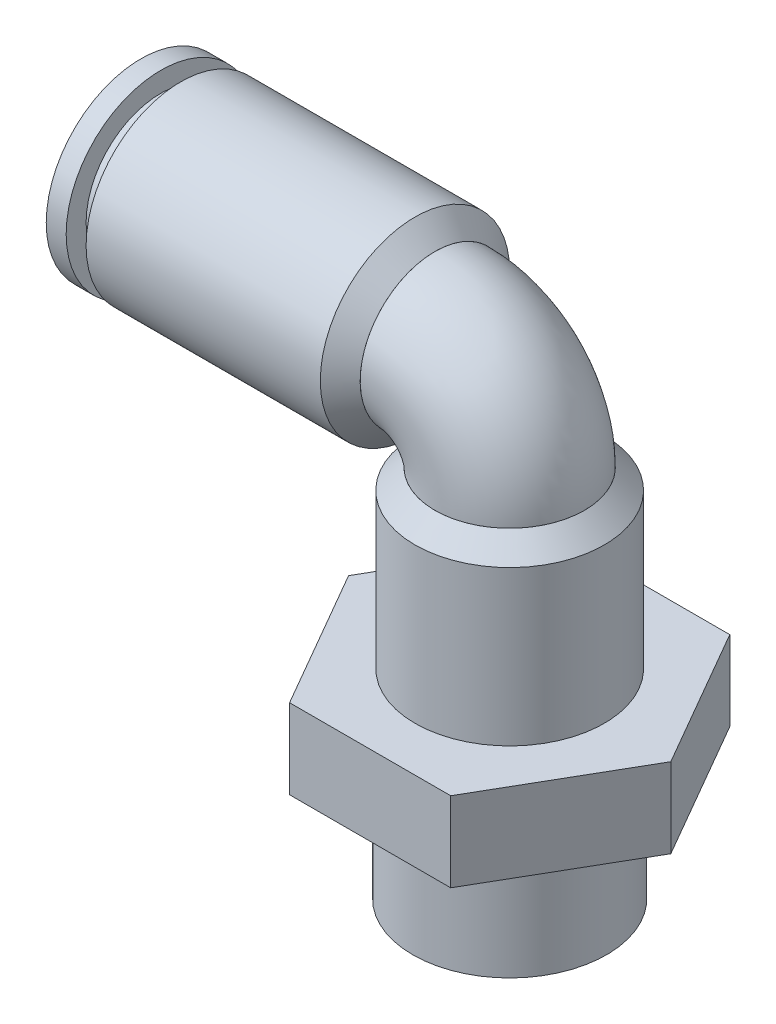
ISO-10303-21;
HEADER;
FILE_DESCRIPTION(('STEP AP214'),'2;1');
FILE_NAME('part.step','',(''),(''),'','','');
FILE_SCHEMA(('AUTOMOTIVE_DESIGN { 1 0 10303 214 1 1 1 1 }'));
ENDSEC;
DATA;
#1=APPLICATION_CONTEXT('core data for automotive mechanical design processes');
#2=APPLICATION_PROTOCOL_DEFINITION('international standard','automotive_design',2000,#1);
#3=PRODUCT_CONTEXT('',#1,'mechanical');
#4=PRODUCT('Part','Part','',(#3));
#5=PRODUCT_RELATED_PRODUCT_CATEGORY('part','',(#4));
#6=PRODUCT_DEFINITION_FORMATION('','',#4);
#7=PRODUCT_DEFINITION_CONTEXT('part definition',#1,'design');
#8=PRODUCT_DEFINITION('design','',#6,#7);
#9=PRODUCT_DEFINITION_SHAPE('','',#8);
#10=(LENGTH_UNIT() NAMED_UNIT(*) SI_UNIT(.MILLI.,.METRE.));
#11=(NAMED_UNIT(*) PLANE_ANGLE_UNIT() SI_UNIT($,.RADIAN.));
#12=(NAMED_UNIT(*) SI_UNIT($,.STERADIAN.) SOLID_ANGLE_UNIT());
#13=UNCERTAINTY_MEASURE_WITH_UNIT(LENGTH_MEASURE(1.E-05),#10,'distance_accuracy_value','');
#14=(GEOMETRIC_REPRESENTATION_CONTEXT(3) GLOBAL_UNCERTAINTY_ASSIGNED_CONTEXT((#13)) GLOBAL_UNIT_ASSIGNED_CONTEXT((#10,
#11,#12)) REPRESENTATION_CONTEXT('',''));
#15=CARTESIAN_POINT('',(0.,0.,0.));
#16=DIRECTION('',(0.,0.,1.));
#17=DIRECTION('',(1.,0.,0.));
#18=AXIS2_PLACEMENT_3D('',#15,#16,#17);
#19=CARTESIAN_POINT('',(-18.5,0.,0.));
#20=DIRECTION('',(-1.,0.,0.));
#21=DIRECTION('',(0.,0.,1.));
#22=AXIS2_PLACEMENT_3D('',#19,#20,#21);
#23=CYLINDRICAL_SURFACE('',#22,4.75);
#24=CARTESIAN_POINT('',(-17.5,0.,0.));
#25=DIRECTION('',(-1.,0.,0.));
#26=DIRECTION('',(0.,0.,1.));
#27=AXIS2_PLACEMENT_3D('',#24,#25,#26);
#28=CIRCLE('',#27,4.75);
#29=CARTESIAN_POINT('',(-17.5,0.,4.75));
#30=VERTEX_POINT('',#29);
#31=EDGE_CURVE('P0_E10',#30,#30,#28,.T.);
#32=ORIENTED_EDGE('',*,*,#31,.T.);
#33=EDGE_LOOP('',(#32));
#34=FACE_BOUND('',#33,.T.);
#35=CARTESIAN_POINT('',(-18.5,0.,0.));
#36=DIRECTION('',(-1.,0.,0.));
#37=DIRECTION('',(0.,0.,1.));
#38=AXIS2_PLACEMENT_3D('',#35,#36,#37);
#39=CIRCLE('',#38,4.75);
#40=CARTESIAN_POINT('',(-18.5,0.,4.75));
#41=VERTEX_POINT('',#40);
#42=EDGE_CURVE('P0_E40',#41,#41,#39,.T.);
#43=ORIENTED_EDGE('',*,*,#42,.F.);
#44=EDGE_LOOP('',(#43));
#45=FACE_BOUND('',#44,.T.);
#46=ADVANCED_FACE('P0_F15',(#34,#45),#23,.T.);
#47=CARTESIAN_POINT('',(-17.5,-4.75,0.));
#48=DIRECTION('',(1.,0.,0.));
#49=DIRECTION('',(0.,0.,-1.));
#50=AXIS2_PLACEMENT_3D('',#47,#48,#49);
#51=PLANE('',#50);
#52=CARTESIAN_POINT('',(-17.5,0.,0.));
#53=DIRECTION('',(-1.,0.,0.));
#54=DIRECTION('',(0.,0.,1.));
#55=AXIS2_PLACEMENT_3D('',#52,#53,#54);
#56=CIRCLE('',#55,3.75);
#57=CARTESIAN_POINT('',(-17.5,0.,3.75));
#58=VERTEX_POINT('',#57);
#59=EDGE_CURVE('P0_E21',#58,#58,#56,.T.);
#60=ORIENTED_EDGE('',*,*,#59,.T.);
#61=EDGE_LOOP('',(#60));
#62=FACE_BOUND('',#61,.T.);
#63=ORIENTED_EDGE('',*,*,#31,.F.);
#64=EDGE_LOOP('',(#63));
#65=FACE_BOUND('',#64,.T.);
#66=ADVANCED_FACE('P0_F60',(#62,#65),#51,.T.);
#67=CARTESIAN_POINT('',(-18.5,0.,0.));
#68=DIRECTION('',(-1.,0.,0.));
#69=DIRECTION('',(0.,0.,1.));
#70=AXIS2_PLACEMENT_3D('',#67,#68,#69);
#71=CYLINDRICAL_SURFACE('',#70,3.75);
#72=CARTESIAN_POINT('',(-16.5,0.,0.));
#73=DIRECTION('',(-1.,0.,0.));
#74=DIRECTION('',(0.,0.,1.));
#75=AXIS2_PLACEMENT_3D('',#72,#73,#74);
#76=CIRCLE('',#75,3.75);
#77=CARTESIAN_POINT('',(-16.5,0.,3.75));
#78=VERTEX_POINT('',#77);
#79=EDGE_CURVE('P0_E25',#78,#78,#76,.T.);
#80=ORIENTED_EDGE('',*,*,#79,.T.);
#81=EDGE_LOOP('',(#80));
#82=FACE_BOUND('',#81,.T.);
#83=ORIENTED_EDGE('',*,*,#59,.F.);
#84=EDGE_LOOP('',(#83));
#85=FACE_BOUND('',#84,.T.);
#86=ADVANCED_FACE('P0_F65',(#82,#85),#71,.T.);
#87=CARTESIAN_POINT('',(-16.5,-3.75,0.));
#88=DIRECTION('',(-1.,0.,0.));
#89=DIRECTION('',(0.,0.,1.));
#90=AXIS2_PLACEMENT_3D('',#87,#88,#89);
#91=PLANE('',#90);
#92=CARTESIAN_POINT('',(-16.5,0.,0.));
#93=DIRECTION('',(-1.,0.,0.));
#94=DIRECTION('',(0.,0.,1.));
#95=AXIS2_PLACEMENT_3D('',#92,#93,#94);
#96=CIRCLE('',#95,4.75);
#97=CARTESIAN_POINT('',(-16.5,0.,4.75));
#98=VERTEX_POINT('',#97);
#99=EDGE_CURVE('P0_E29',#98,#98,#96,.T.);
#100=ORIENTED_EDGE('',*,*,#99,.T.);
#101=EDGE_LOOP('',(#100));
#102=FACE_BOUND('',#101,.T.);
#103=ORIENTED_EDGE('',*,*,#79,.F.);
#104=EDGE_LOOP('',(#103));
#105=FACE_BOUND('',#104,.T.);
#106=ADVANCED_FACE('P0_F69',(#102,#105),#91,.T.);
#107=CARTESIAN_POINT('',(-18.5,0.,0.));
#108=DIRECTION('',(-1.,0.,0.));
#109=DIRECTION('',(0.,0.,1.));
#110=AXIS2_PLACEMENT_3D('',#107,#108,#109);
#111=CYLINDRICAL_SURFACE('',#110,4.75);
#112=CARTESIAN_POINT('',(-4.75,0.,0.));
#113=DIRECTION('',(-1.,0.,0.));
#114=DIRECTION('',(0.,0.,1.));
#115=AXIS2_PLACEMENT_3D('',#112,#113,#114);
#116=CIRCLE('',#115,4.75);
#117=CARTESIAN_POINT('',(-4.75,0.,4.75));
#118=VERTEX_POINT('',#117);
#119=EDGE_CURVE('P0_E34',#118,#118,#116,.T.);
#120=ORIENTED_EDGE('',*,*,#119,.T.);
#121=EDGE_LOOP('',(#120));
#122=FACE_BOUND('',#121,.T.);
#123=ORIENTED_EDGE('',*,*,#99,.F.);
#124=EDGE_LOOP('',(#123));
#125=FACE_BOUND('',#124,.T.);
#126=ADVANCED_FACE('P0_F76',(#122,#125),#111,.T.);
#127=CARTESIAN_POINT('',(-4.75,0.,0.));
#128=DIRECTION('',(-1.,0.,0.));
#129=DIRECTION('',(0.,0.,1.));
#130=AXIS2_PLACEMENT_3D('',#127,#128,#129);
#131=CONICAL_SURFACE('',#130,4.75,0.78539816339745);
#132=CARTESIAN_POINT('',(-3.75,0.,0.));
#133=DIRECTION('',(-1.,0.,0.));
#134=DIRECTION('',(0.,0.,1.));
#135=AXIS2_PLACEMENT_3D('',#132,#133,#134);
#136=CIRCLE('',#135,3.75);
#137=CARTESIAN_POINT('',(-3.75,0.,3.75));
#138=VERTEX_POINT('',#137);
#139=EDGE_CURVE('P0_E37',#138,#138,#136,.T.);
#140=ORIENTED_EDGE('',*,*,#139,.T.);
#141=EDGE_LOOP('',(#140));
#142=FACE_BOUND('',#141,.T.);
#143=ORIENTED_EDGE('',*,*,#119,.F.);
#144=EDGE_LOOP('',(#143));
#145=FACE_BOUND('',#144,.T.);
#146=ADVANCED_FACE('P0_F80',(#142,#145),#131,.T.);
#147=CARTESIAN_POINT('',(-3.75,-3.75,0.));
#148=DIRECTION('',(1.,0.,0.));
#149=DIRECTION('',(0.,0.,-1.));
#150=AXIS2_PLACEMENT_3D('',#147,#148,#149);
#151=PLANE('',#150);
#152=CARTESIAN_POINT('',(-3.75,0.,0.));
#153=DIRECTION('',(1.,0.,0.));
#154=DIRECTION('',(0.,0.,-1.));
#155=AXIS2_PLACEMENT_3D('',#152,#153,#154);
#156=CIRCLE('',#155,2.);
#157=CARTESIAN_POINT('',(-3.75,0.,-2.));
#158=VERTEX_POINT('',#157);
#159=EDGE_CURVE('P0_E43',#158,#158,#156,.T.);
#160=ORIENTED_EDGE('',*,*,#159,.F.);
#161=EDGE_LOOP('',(#160));
#162=FACE_BOUND('',#161,.T.);
#163=ORIENTED_EDGE('',*,*,#139,.F.);
#164=EDGE_LOOP('',(#163));
#165=FACE_BOUND('',#164,.T.);
#166=ADVANCED_FACE('P0_F55',(#162,#165),#151,.T.);
#167=CARTESIAN_POINT('',(-18.5,0.,0.));
#168=DIRECTION('',(-1.,0.,0.));
#169=DIRECTION('',(0.,0.,1.));
#170=AXIS2_PLACEMENT_3D('',#167,#168,#169);
#171=PLANE('',#170);
#172=CARTESIAN_POINT('',(-18.5,0.,0.));
#173=DIRECTION('',(-1.,0.,0.));
#174=DIRECTION('',(0.,0.,1.));
#175=AXIS2_PLACEMENT_3D('',#172,#173,#174);
#176=CIRCLE('',#175,2.);
#177=CARTESIAN_POINT('',(-18.5,0.,2.));
#178=VERTEX_POINT('',#177);
#179=EDGE_CURVE('P0_E46',#178,#178,#176,.T.);
#180=ORIENTED_EDGE('',*,*,#179,.F.);
#181=EDGE_LOOP('',(#180));
#182=FACE_BOUND('',#181,.T.);
#183=ORIENTED_EDGE('',*,*,#42,.T.);
#184=EDGE_LOOP('',(#183));
#185=FACE_BOUND('',#184,.T.);
#186=ADVANCED_FACE('P0_F52',(#182,#185),#171,.T.);
#187=CARTESIAN_POINT('',(-1.5,0.,0.));
#188=DIRECTION('',(-1.,0.,0.));
#189=DIRECTION('',(0.,0.,1.));
#190=AXIS2_PLACEMENT_3D('',#187,#188,#189);
#191=CYLINDRICAL_SURFACE('',#190,2.);
#192=ORIENTED_EDGE('',*,*,#159,.T.);
#193=EDGE_LOOP('',(#192));
#194=FACE_BOUND('',#193,.T.);
#195=ORIENTED_EDGE('',*,*,#179,.T.);
#196=EDGE_LOOP('',(#195));
#197=FACE_BOUND('',#196,.T.);
#198=ADVANCED_FACE('P0_F50',(#194,#197),#191,.F.);
#199=CLOSED_SHELL('',(#46,#66,#86,#106,#126,#146,#166,#186,#198));
#200=MANIFOLD_SOLID_BREP('P0_B1',#199);
#201=CARTESIAN_POINT('',(-9.,-16.5,0.));
#202=DIRECTION('',(0.,-1.,0.));
#203=DIRECTION('',(0.,0.,-1.));
#204=AXIS2_PLACEMENT_3D('',#201,#202,#203);
#205=PLANE('',#204);
#206=CARTESIAN_POINT('',(0.,-16.5,0.));
#207=DIRECTION('',(0.,1.,0.));
#208=DIRECTION('',(0.,0.,1.));
#209=AXIS2_PLACEMENT_3D('',#206,#207,#208);
#210=CIRCLE('',#209,4.864);
#211=CARTESIAN_POINT('',(0.,-16.5,4.864));
#212=VERTEX_POINT('',#211);
#213=EDGE_CURVE('P1_E26',#212,#212,#210,.T.);
#214=ORIENTED_EDGE('',*,*,#213,.T.);
#215=EDGE_LOOP('',(#214));
#216=FACE_BOUND('',#215,.T.);
#217=DIRECTION('',(1.,0.,0.));
#218=VECTOR('',#217,1.);
#219=CARTESIAN_POINT('',(-4.04145188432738,-16.5,-7.));
#220=LINE('',#219,#218);
#221=CARTESIAN_POINT('',(-4.04145188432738,-16.5,-7.));
#222=VERTEX_POINT('',#221);
#223=CARTESIAN_POINT('',(4.04145188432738,-16.5,-7.));
#224=VERTEX_POINT('',#223);
#225=EDGE_CURVE('P1_E107',#222,#224,#220,.T.);
#226=ORIENTED_EDGE('',*,*,#225,.T.);
#227=DIRECTION('',(0.5,0.,0.866025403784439));
#228=VECTOR('',#227,1.);
#229=CARTESIAN_POINT('',(4.04145188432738,-16.5,-7.));
#230=LINE('',#229,#228);
#231=CARTESIAN_POINT('',(8.08290376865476,-16.5,0.));
#232=VERTEX_POINT('',#231);
#233=EDGE_CURVE('P1_E73',#224,#232,#230,.T.);
#234=ORIENTED_EDGE('',*,*,#233,.T.);
#235=DIRECTION('',(-0.5,0.,0.866025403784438));
#236=VECTOR('',#235,1.);
#237=CARTESIAN_POINT('',(8.08290376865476,-16.5,0.));
#238=LINE('',#237,#236);
#239=CARTESIAN_POINT('',(4.04145188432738,-16.5,7.));
#240=VERTEX_POINT('',#239);
#241=EDGE_CURVE('P1_E85',#232,#240,#238,.T.);
#242=ORIENTED_EDGE('',*,*,#241,.T.);
#243=DIRECTION('',(-1.,0.,0.));
#244=VECTOR('',#243,1.);
#245=CARTESIAN_POINT('',(4.04145188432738,-16.5,7.));
#246=LINE('',#245,#244);
#247=CARTESIAN_POINT('',(-4.04145188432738,-16.5,7.));
#248=VERTEX_POINT('',#247);
#249=EDGE_CURVE('P1_E33',#240,#248,#246,.T.);
#250=ORIENTED_EDGE('',*,*,#249,.T.);
#251=DIRECTION('',(-0.5,0.,-0.866025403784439));
#252=VECTOR('',#251,1.);
#253=CARTESIAN_POINT('',(-4.04145188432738,-16.5,7.));
#254=LINE('',#253,#252);
#255=CARTESIAN_POINT('',(-8.08290376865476,-16.5,0.));
#256=VERTEX_POINT('',#255);
#257=EDGE_CURVE('P1_E113',#248,#256,#254,.T.);
#258=ORIENTED_EDGE('',*,*,#257,.T.);
#259=DIRECTION('',(0.5,0.,-0.866025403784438));
#260=VECTOR('',#259,1.);
#261=CARTESIAN_POINT('',(-8.08290376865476,-16.5,0.));
#262=LINE('',#261,#260);
#263=EDGE_CURVE('P1_E110',#256,#222,#262,.T.);
#264=ORIENTED_EDGE('',*,*,#263,.T.);
#265=EDGE_LOOP('',(#226,#234,#242,#250,#258,#264));
#266=FACE_BOUND('',#265,.T.);
#267=ADVANCED_FACE('P1_F17',(#216,#266),#205,.T.);
#268=CARTESIAN_POINT('',(-4.75,-12.5,0.));
#269=DIRECTION('',(0.,1.,0.));
#270=DIRECTION('',(0.,0.,1.));
#271=AXIS2_PLACEMENT_3D('',#268,#269,#270);
#272=PLANE('',#271);
#273=CARTESIAN_POINT('',(0.,-12.5,0.));
#274=DIRECTION('',(0.,1.,0.));
#275=DIRECTION('',(0.,0.,1.));
#276=AXIS2_PLACEMENT_3D('',#273,#274,#275);
#277=CIRCLE('',#276,4.75);
#278=CARTESIAN_POINT('',(0.,-12.5,4.75));
#279=VERTEX_POINT('',#278);
#280=EDGE_CURVE('P1_E126',#279,#279,#277,.T.);
#281=ORIENTED_EDGE('',*,*,#280,.F.);
#282=EDGE_LOOP('',(#281));
#283=FACE_BOUND('',#282,.T.);
#284=DIRECTION('',(-0.5,0.,0.866025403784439));
#285=VECTOR('',#284,1.);
#286=CARTESIAN_POINT('',(8.08290376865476,-12.5,0.));
#287=LINE('',#286,#285);
#288=CARTESIAN_POINT('',(8.08290376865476,-12.5,0.));
#289=VERTEX_POINT('',#288);
#290=CARTESIAN_POINT('',(4.04145188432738,-12.5,7.));
#291=VERTEX_POINT('',#290);
#292=EDGE_CURVE('P1_E91',#289,#291,#287,.T.);
#293=ORIENTED_EDGE('',*,*,#292,.F.);
#294=DIRECTION('',(0.5,0.,0.866025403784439));
#295=VECTOR('',#294,1.);
#296=CARTESIAN_POINT('',(4.04145188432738,-12.5,-7.));
#297=LINE('',#296,#295);
#298=CARTESIAN_POINT('',(4.04145188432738,-12.5,-7.));
#299=VERTEX_POINT('',#298);
#300=EDGE_CURVE('P1_E41',#299,#289,#297,.T.);
#301=ORIENTED_EDGE('',*,*,#300,.F.);
#302=DIRECTION('',(1.,0.,0.));
#303=VECTOR('',#302,1.);
#304=CARTESIAN_POINT('',(-4.04145188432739,-12.5,-7.));
#305=LINE('',#304,#303);
#306=CARTESIAN_POINT('',(-4.04145188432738,-12.5,-7.));
#307=VERTEX_POINT('',#306);
#308=EDGE_CURVE('P1_E79',#307,#299,#305,.T.);
#309=ORIENTED_EDGE('',*,*,#308,.F.);
#310=DIRECTION('',(0.5,0.,-0.866025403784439));
#311=VECTOR('',#310,1.);
#312=CARTESIAN_POINT('',(-8.08290376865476,-12.5,0.));
#313=LINE('',#312,#311);
#314=CARTESIAN_POINT('',(-8.08290376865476,-12.5,0.));
#315=VERTEX_POINT('',#314);
#316=EDGE_CURVE('P1_E98',#315,#307,#313,.T.);
#317=ORIENTED_EDGE('',*,*,#316,.F.);
#318=DIRECTION('',(-0.5,0.,-0.866025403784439));
#319=VECTOR('',#318,1.);
#320=CARTESIAN_POINT('',(-4.04145188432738,-12.5,7.));
#321=LINE('',#320,#319);
#322=CARTESIAN_POINT('',(-4.04145188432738,-12.5,7.));
#323=VERTEX_POINT('',#322);
#324=EDGE_CURVE('P1_E101',#323,#315,#321,.T.);
#325=ORIENTED_EDGE('',*,*,#324,.F.);
#326=DIRECTION('',(-1.,0.,0.));
#327=VECTOR('',#326,1.);
#328=CARTESIAN_POINT('',(4.04145188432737,-12.5,7.));
#329=LINE('',#328,#327);
#330=EDGE_CURVE('P1_E93',#291,#323,#329,.T.);
#331=ORIENTED_EDGE('',*,*,#330,.F.);
#332=EDGE_LOOP('',(#293,#301,#309,#317,#325,#331));
#333=FACE_BOUND('',#332,.T.);
#334=ADVANCED_FACE('P1_F88',(#283,#333),#272,.T.);
#335=CARTESIAN_POINT('',(-4.864,-22.5,0.));
#336=DIRECTION('',(0.,-1.,0.));
#337=DIRECTION('',(0.,0.,-1.));
#338=AXIS2_PLACEMENT_3D('',#335,#336,#337);
#339=PLANE('',#338);
#340=CARTESIAN_POINT('',(0.,-22.5,0.));
#341=DIRECTION('',(0.,1.,0.));
#342=DIRECTION('',(0.,0.,1.));
#343=AXIS2_PLACEMENT_3D('',#340,#341,#342);
#344=CIRCLE('',#343,1.5);
#345=CARTESIAN_POINT('',(0.,-22.5,1.5));
#346=VERTEX_POINT('',#345);
#347=EDGE_CURVE('P1_E100',#346,#346,#344,.T.);
#348=ORIENTED_EDGE('',*,*,#347,.T.);
#349=EDGE_LOOP('',(#348));
#350=FACE_BOUND('',#349,.T.);
#351=CARTESIAN_POINT('',(0.,-22.5,0.));
#352=DIRECTION('',(0.,1.,0.));
#353=DIRECTION('',(0.,0.,1.));
#354=AXIS2_PLACEMENT_3D('',#351,#352,#353);
#355=CIRCLE('',#354,4.864);
#356=CARTESIAN_POINT('',(0.,-22.5,4.864));
#357=VERTEX_POINT('',#356);
#358=EDGE_CURVE('P1_E11',#357,#357,#355,.T.);
#359=ORIENTED_EDGE('',*,*,#358,.F.);
#360=EDGE_LOOP('',(#359));
#361=FACE_BOUND('',#360,.T.);
#362=ADVANCED_FACE('P1_F19',(#350,#361),#339,.T.);
#363=CARTESIAN_POINT('',(0.,0.,0.));
#364=DIRECTION('',(0.,1.,0.));
#365=DIRECTION('',(0.,0.,1.));
#366=AXIS2_PLACEMENT_3D('',#363,#364,#365);
#367=CYLINDRICAL_SURFACE('',#366,4.864);
#368=ORIENTED_EDGE('',*,*,#358,.T.);
#369=EDGE_LOOP('',(#368));
#370=FACE_BOUND('',#369,.T.);
#371=ORIENTED_EDGE('',*,*,#213,.F.);
#372=EDGE_LOOP('',(#371));
#373=FACE_BOUND('',#372,.T.);
#374=ADVANCED_FACE('P1_F134',(#370,#373),#367,.T.);
#375=CARTESIAN_POINT('',(0.,0.,0.));
#376=DIRECTION('',(0.,1.,0.));
#377=DIRECTION('',(0.,0.,1.));
#378=AXIS2_PLACEMENT_3D('',#375,#376,#377);
#379=CYLINDRICAL_SURFACE('',#378,4.75);
#380=ORIENTED_EDGE('',*,*,#280,.T.);
#381=EDGE_LOOP('',(#380));
#382=FACE_BOUND('',#381,.T.);
#383=CARTESIAN_POINT('',(0.,-4.75,0.));
#384=DIRECTION('',(0.,1.,0.));
#385=DIRECTION('',(0.,0.,1.));
#386=AXIS2_PLACEMENT_3D('',#383,#384,#385);
#387=CIRCLE('',#386,4.75);
#388=CARTESIAN_POINT('',(0.,-4.75,4.75));
#389=VERTEX_POINT('',#388);
#390=EDGE_CURVE('P1_E123',#389,#389,#387,.T.);
#391=ORIENTED_EDGE('',*,*,#390,.F.);
#392=EDGE_LOOP('',(#391));
#393=FACE_BOUND('',#392,.T.);
#394=ADVANCED_FACE('P1_F136',(#382,#393),#379,.T.);
#395=CARTESIAN_POINT('',(0.,-3.75,0.));
#396=DIRECTION('',(0.,-1.,0.));
#397=DIRECTION('',(0.,0.,-1.));
#398=AXIS2_PLACEMENT_3D('',#395,#396,#397);
#399=CONICAL_SURFACE('',#398,3.75,0.785398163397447);
#400=ORIENTED_EDGE('',*,*,#390,.T.);
#401=EDGE_LOOP('',(#400));
#402=FACE_BOUND('',#401,.T.);
#403=CARTESIAN_POINT('',(0.,-3.75,0.));
#404=DIRECTION('',(0.,1.,0.));
#405=DIRECTION('',(0.,0.,1.));
#406=AXIS2_PLACEMENT_3D('',#403,#404,#405);
#407=CIRCLE('',#406,3.75);
#408=CARTESIAN_POINT('',(0.,-3.75,3.75));
#409=VERTEX_POINT('',#408);
#410=EDGE_CURVE('P1_E120',#409,#409,#407,.T.);
#411=ORIENTED_EDGE('',*,*,#410,.F.);
#412=EDGE_LOOP('',(#411));
#413=FACE_BOUND('',#412,.T.);
#414=ADVANCED_FACE('P1_F143',(#402,#413),#399,.T.);
#415=CARTESIAN_POINT('',(0.,-3.75,0.));
#416=DIRECTION('',(0.,1.,0.));
#417=DIRECTION('',(0.,0.,1.));
#418=AXIS2_PLACEMENT_3D('',#415,#416,#417);
#419=PLANE('',#418);
#420=CARTESIAN_POINT('',(0.,-3.75,0.));
#421=DIRECTION('',(0.,1.,0.));
#422=DIRECTION('',(0.,0.,1.));
#423=AXIS2_PLACEMENT_3D('',#420,#421,#422);
#424=CIRCLE('',#423,1.5);
#425=CARTESIAN_POINT('',(0.,-3.75,1.5));
#426=VERTEX_POINT('',#425);
#427=EDGE_CURVE('P1_E21',#426,#426,#424,.F.);
#428=ORIENTED_EDGE('',*,*,#427,.T.);
#429=EDGE_LOOP('',(#428));
#430=FACE_BOUND('',#429,.T.);
#431=ORIENTED_EDGE('',*,*,#410,.T.);
#432=EDGE_LOOP('',(#431));
#433=FACE_BOUND('',#432,.T.);
#434=ADVANCED_FACE('P1_F157',(#430,#433),#419,.T.);
#435=CARTESIAN_POINT('',(0.,-3.,0.));
#436=DIRECTION('',(0.,-1.,0.));
#437=DIRECTION('',(1.,0.,0.));
#438=AXIS2_PLACEMENT_3D('',#435,#436,#437);
#439=CYLINDRICAL_SURFACE('',#438,1.5);
#440=ORIENTED_EDGE('',*,*,#427,.F.);
#441=EDGE_LOOP('',(#440));
#442=FACE_BOUND('',#441,.T.);
#443=ORIENTED_EDGE('',*,*,#347,.F.);
#444=EDGE_LOOP('',(#443));
#445=FACE_BOUND('',#444,.T.);
#446=ADVANCED_FACE('P1_F161',(#442,#445),#439,.F.);
#447=CARTESIAN_POINT('',(4.04145188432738,20.6958284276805,-7.));
#448=DIRECTION('',(0.866025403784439,0.,-0.5));
#449=DIRECTION('',(-0.5,0.,-0.866025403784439));
#450=AXIS2_PLACEMENT_3D('',#447,#448,#449);
#451=PLANE('',#450);
#452=ORIENTED_EDGE('',*,*,#300,.T.);
#453=DIRECTION('',(0.,-1.,0.));
#454=VECTOR('',#453,1.);
#455=CARTESIAN_POINT('',(8.08290376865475,20.6958284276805,0.));
#456=LINE('',#455,#454);
#457=EDGE_CURVE('P1_E116',#289,#232,#456,.T.);
#458=ORIENTED_EDGE('',*,*,#457,.T.);
#459=ORIENTED_EDGE('',*,*,#233,.F.);
#460=DIRECTION('',(0.,-1.,0.));
#461=VECTOR('',#460,1.);
#462=CARTESIAN_POINT('',(4.04145188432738,20.6958284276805,-7.));
#463=LINE('',#462,#461);
#464=EDGE_CURVE('P1_E69',#299,#224,#463,.T.);
#465=ORIENTED_EDGE('',*,*,#464,.F.);
#466=EDGE_LOOP('',(#452,#458,#459,#465));
#467=FACE_BOUND('',#466,.T.);
#468=ADVANCED_FACE('P1_F71',(#467),#451,.T.);
#469=CARTESIAN_POINT('',(-4.04145188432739,20.6958284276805,-7.));
#470=DIRECTION('',(0.,0.,-1.));
#471=DIRECTION('',(-1.,0.,0.));
#472=AXIS2_PLACEMENT_3D('',#469,#470,#471);
#473=PLANE('',#472);
#474=ORIENTED_EDGE('',*,*,#308,.T.);
#475=ORIENTED_EDGE('',*,*,#464,.T.);
#476=ORIENTED_EDGE('',*,*,#225,.F.);
#477=DIRECTION('',(0.,-1.,0.));
#478=VECTOR('',#477,1.);
#479=CARTESIAN_POINT('',(-4.04145188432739,20.6958284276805,-7.));
#480=LINE('',#479,#478);
#481=EDGE_CURVE('P1_E81',#307,#222,#480,.T.);
#482=ORIENTED_EDGE('',*,*,#481,.F.);
#483=EDGE_LOOP('',(#474,#475,#476,#482));
#484=FACE_BOUND('',#483,.T.);
#485=ADVANCED_FACE('P1_F80',(#484),#473,.T.);
#486=CARTESIAN_POINT('',(-8.08290376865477,20.6958284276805,0.));
#487=DIRECTION('',(-0.866025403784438,0.,-0.5));
#488=DIRECTION('',(-0.5,0.,0.866025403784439));
#489=AXIS2_PLACEMENT_3D('',#486,#487,#488);
#490=PLANE('',#489);
#491=ORIENTED_EDGE('',*,*,#316,.T.);
#492=ORIENTED_EDGE('',*,*,#481,.T.);
#493=ORIENTED_EDGE('',*,*,#263,.F.);
#494=DIRECTION('',(0.,-1.,0.));
#495=VECTOR('',#494,1.);
#496=CARTESIAN_POINT('',(-8.08290376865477,20.6958284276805,0.));
#497=LINE('',#496,#495);
#498=EDGE_CURVE('P1_E108',#315,#256,#497,.T.);
#499=ORIENTED_EDGE('',*,*,#498,.F.);
#500=EDGE_LOOP('',(#491,#492,#493,#499));
#501=FACE_BOUND('',#500,.T.);
#502=ADVANCED_FACE('P1_F170',(#501),#490,.T.);
#503=CARTESIAN_POINT('',(-4.04145188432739,20.6958284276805,7.));
#504=DIRECTION('',(-0.866025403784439,0.,0.5));
#505=DIRECTION('',(0.5,0.,0.866025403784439));
#506=AXIS2_PLACEMENT_3D('',#503,#504,#505);
#507=PLANE('',#506);
#508=ORIENTED_EDGE('',*,*,#324,.T.);
#509=ORIENTED_EDGE('',*,*,#498,.T.);
#510=ORIENTED_EDGE('',*,*,#257,.F.);
#511=DIRECTION('',(0.,-1.,0.));
#512=VECTOR('',#511,1.);
#513=CARTESIAN_POINT('',(-4.04145188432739,20.6958284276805,7.));
#514=LINE('',#513,#512);
#515=EDGE_CURVE('P1_E111',#323,#248,#514,.T.);
#516=ORIENTED_EDGE('',*,*,#515,.F.);
#517=EDGE_LOOP('',(#508,#509,#510,#516));
#518=FACE_BOUND('',#517,.T.);
#519=ADVANCED_FACE('P1_F173',(#518),#507,.T.);
#520=CARTESIAN_POINT('',(4.04145188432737,20.6958284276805,7.));
#521=DIRECTION('',(0.,0.,1.));
#522=DIRECTION('',(1.,0.,0.));
#523=AXIS2_PLACEMENT_3D('',#520,#521,#522);
#524=PLANE('',#523);
#525=ORIENTED_EDGE('',*,*,#330,.T.);
#526=ORIENTED_EDGE('',*,*,#515,.T.);
#527=ORIENTED_EDGE('',*,*,#249,.F.);
#528=DIRECTION('',(0.,-1.,0.));
#529=VECTOR('',#528,1.);
#530=CARTESIAN_POINT('',(4.04145188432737,20.6958284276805,7.));
#531=LINE('',#530,#529);
#532=EDGE_CURVE('P1_E114',#291,#240,#531,.T.);
#533=ORIENTED_EDGE('',*,*,#532,.F.);
#534=EDGE_LOOP('',(#525,#526,#527,#533));
#535=FACE_BOUND('',#534,.T.);
#536=ADVANCED_FACE('P1_F177',(#535),#524,.T.);
#537=CARTESIAN_POINT('',(8.08290376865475,20.6958284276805,0.));
#538=DIRECTION('',(0.866025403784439,0.,0.5));
#539=DIRECTION('',(0.5,0.,-0.866025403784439));
#540=AXIS2_PLACEMENT_3D('',#537,#538,#539);
#541=PLANE('',#540);
#542=ORIENTED_EDGE('',*,*,#292,.T.);
#543=ORIENTED_EDGE('',*,*,#532,.T.);
#544=ORIENTED_EDGE('',*,*,#241,.F.);
#545=ORIENTED_EDGE('',*,*,#457,.F.);
#546=EDGE_LOOP('',(#542,#543,#544,#545));
#547=FACE_BOUND('',#546,.T.);
#548=ADVANCED_FACE('P1_F181',(#547),#541,.T.);
#549=CLOSED_SHELL('',(#267,#334,#362,#374,#394,#414,#434,#446,#468,#485,#502,#519,#536,#548));
#550=MANIFOLD_SOLID_BREP('P1_B1',#549);
#551=CARTESIAN_POINT('',(-3.75,-3.75,0.));
#552=DIRECTION('',(0.,0.,1.));
#553=DIRECTION('',(1.,0.,0.));
#554=AXIS2_PLACEMENT_3D('',#551,#552,#553);
#555=TOROIDAL_SURFACE('',#554,3.75,3.749);
#556=CARTESIAN_POINT('',(0.,-3.75000000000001,0.));
#557=DIRECTION('',(0.,-1.,0.));
#558=DIRECTION('',(0.,0.,-1.));
#559=AXIS2_PLACEMENT_3D('',#556,#557,#558);
#560=CIRCLE('',#559,3.749);
#561=CARTESIAN_POINT('',(3.749,-3.75000000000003,0.));
#562=VERTEX_POINT('',#561);
#563=EDGE_CURVE('P2_E9',#562,#562,#560,.T.);
#564=CARTESIAN_POINT('',(-3.75,0.,0.));
#565=DIRECTION('',(1.,0.,0.));
#566=DIRECTION('',(0.,0.,-1.));
#567=AXIS2_PLACEMENT_3D('',#564,#565,#566);
#568=CIRCLE('',#567,3.749);
#569=CARTESIAN_POINT('',(-3.75,3.749,0.));
#570=VERTEX_POINT('',#569);
#571=EDGE_CURVE('P2_E21',#570,#570,#568,.T.);
#572=CARTESIAN_POINT('',(-3.75,-3.75,0.));
#573=DIRECTION('',(0.,0.,1.));
#574=DIRECTION('',(1.,0.,0.));
#575=AXIS2_PLACEMENT_3D('',#572,#573,#574);
#576=CIRCLE('',#575,7.499);
#577=EDGE_CURVE('',#562,#570,#576,.T.);
#578=ORIENTED_EDGE('',*,*,#563,.F.);
#579=ORIENTED_EDGE('',*,*,#571,.T.);
#580=ORIENTED_EDGE('',*,*,#577,.T.);
#581=ORIENTED_EDGE('',*,*,#577,.F.);
#582=EDGE_LOOP('',(#578,#580,#579,#581));
#583=FACE_BOUND('',#582,.T.);
#584=ADVANCED_FACE('P2_F14',(#583),#555,.T.);
#585=CARTESIAN_POINT('',(0.,-3.75000000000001,0.));
#586=DIRECTION('',(0.,-1.,0.));
#587=DIRECTION('',(0.,0.,-1.));
#588=AXIS2_PLACEMENT_3D('',#585,#586,#587);
#589=PLANE('',#588);
#590=CARTESIAN_POINT('',(0.,-3.75000000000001,0.));
#591=DIRECTION('',(0.,-1.,0.));
#592=DIRECTION('',(1.,0.,0.));
#593=AXIS2_PLACEMENT_3D('',#590,#591,#592);
#594=CIRCLE('',#593,1.5);
#595=CARTESIAN_POINT('',(1.5,-3.75000000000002,0.));
#596=VERTEX_POINT('',#595);
#597=EDGE_CURVE('P2_E17',#596,#596,#594,.F.);
#598=ORIENTED_EDGE('',*,*,#597,.T.);
#599=EDGE_LOOP('',(#598));
#600=FACE_BOUND('',#599,.T.);
#601=ORIENTED_EDGE('',*,*,#563,.T.);
#602=EDGE_LOOP('',(#601));
#603=FACE_BOUND('',#602,.T.);
#604=ADVANCED_FACE('P2_F58',(#600,#603),#589,.T.);
#605=CARTESIAN_POINT('',(-3.75,0.,0.));
#606=DIRECTION('',(1.,0.,0.));
#607=DIRECTION('',(0.,0.,-1.));
#608=AXIS2_PLACEMENT_3D('',#605,#606,#607);
#609=PLANE('',#608);
#610=CARTESIAN_POINT('',(-3.75,0.,0.));
#611=DIRECTION('',(1.,0.,0.));
#612=DIRECTION('',(0.,0.,-1.));
#613=AXIS2_PLACEMENT_3D('',#610,#611,#612);
#614=CIRCLE('',#613,1.5);
#615=CARTESIAN_POINT('',(-3.75,0.,-1.5));
#616=VERTEX_POINT('',#615);
#617=EDGE_CURVE('P2_E28',#616,#616,#614,.T.);
#618=ORIENTED_EDGE('',*,*,#617,.T.);
#619=EDGE_LOOP('',(#618));
#620=FACE_BOUND('',#619,.T.);
#621=ORIENTED_EDGE('',*,*,#571,.F.);
#622=EDGE_LOOP('',(#621));
#623=FACE_BOUND('',#622,.T.);
#624=ADVANCED_FACE('P2_F49',(#620,#623),#609,.F.);
#625=CARTESIAN_POINT('',(-3.,0.,0.));
#626=DIRECTION('',(-1.,0.,0.));
#627=DIRECTION('',(0.,-1.,0.));
#628=AXIS2_PLACEMENT_3D('',#625,#626,#627);
#629=CYLINDRICAL_SURFACE('',#628,1.5);
#630=CARTESIAN_POINT('',(-3.,0.,0.));
#631=DIRECTION('',(-1.,0.,0.));
#632=DIRECTION('',(0.,0.,1.));
#633=AXIS2_PLACEMENT_3D('',#630,#631,#632);
#634=CIRCLE('',#633,1.5);
#635=CARTESIAN_POINT('',(-3.,1.5,0.));
#636=VERTEX_POINT('',#635);
#637=EDGE_CURVE('P2_E35',#636,#636,#634,.T.);
#638=ORIENTED_EDGE('',*,*,#637,.F.);
#639=EDGE_LOOP('',(#638));
#640=FACE_BOUND('',#639,.T.);
#641=ORIENTED_EDGE('',*,*,#617,.F.);
#642=EDGE_LOOP('',(#641));
#643=FACE_BOUND('',#642,.T.);
#644=ADVANCED_FACE('P2_F45',(#640,#643),#629,.F.);
#645=CARTESIAN_POINT('',(0.,-3.,0.));
#646=DIRECTION('',(0.,-1.,0.));
#647=DIRECTION('',(1.,0.,0.));
#648=AXIS2_PLACEMENT_3D('',#645,#646,#647);
#649=CYLINDRICAL_SURFACE('',#648,1.5);
#650=ORIENTED_EDGE('',*,*,#597,.F.);
#651=EDGE_LOOP('',(#650));
#652=FACE_BOUND('',#651,.T.);
#653=CARTESIAN_POINT('',(0.,-3.,0.));
#654=DIRECTION('',(0.,1.,0.));
#655=DIRECTION('',(0.,0.,1.));
#656=AXIS2_PLACEMENT_3D('',#653,#654,#655);
#657=CIRCLE('',#656,1.5);
#658=CARTESIAN_POINT('',(1.5,-3.,0.));
#659=VERTEX_POINT('',#658);
#660=EDGE_CURVE('P2_E30',#659,#659,#657,.T.);
#661=ORIENTED_EDGE('',*,*,#660,.T.);
#662=EDGE_LOOP('',(#661));
#663=FACE_BOUND('',#662,.T.);
#664=ADVANCED_FACE('P2_F48',(#652,#663),#649,.F.);
#665=CARTESIAN_POINT('',(-3.,-3.,0.));
#666=DIRECTION('',(0.,0.,-1.));
#667=DIRECTION('',(-1.,0.,0.));
#668=AXIS2_PLACEMENT_3D('',#665,#666,#667);
#669=TOROIDAL_SURFACE('',#668,3.,1.5);
#670=CARTESIAN_POINT('',(-3.,-3.,0.));
#671=DIRECTION('',(0.,0.,-1.));
#672=DIRECTION('',(-1.,0.,0.));
#673=AXIS2_PLACEMENT_3D('',#670,#671,#672);
#674=CIRCLE('',#673,4.5);
#675=EDGE_CURVE('',#636,#659,#674,.T.);
#676=ORIENTED_EDGE('',*,*,#637,.T.);
#677=ORIENTED_EDGE('',*,*,#660,.F.);
#678=ORIENTED_EDGE('',*,*,#675,.T.);
#679=ORIENTED_EDGE('',*,*,#675,.F.);
#680=EDGE_LOOP('',(#676,#678,#677,#679));
#681=FACE_BOUND('',#680,.T.);
#682=ADVANCED_FACE('P2_F42',(#681),#669,.F.);
#683=CLOSED_SHELL('',(#584,#604,#624,#644,#664,#682));
#684=MANIFOLD_SOLID_BREP('P2_B1',#683);
#685=ADVANCED_BREP_SHAPE_REPRESENTATION('',(#18,#200,#550,#684),#14);
#686=SHAPE_DEFINITION_REPRESENTATION(#9,#685);
ENDSEC;
END-ISO-10303-21;
